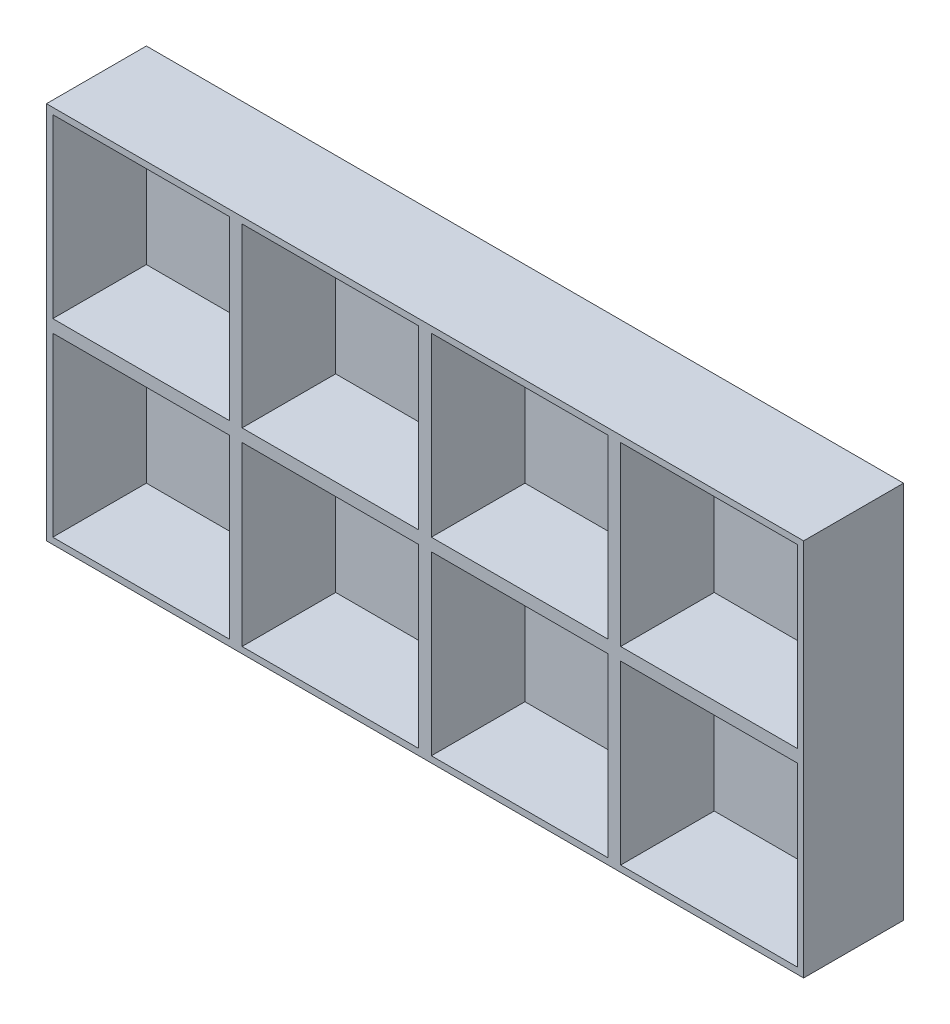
from build123d import *

# Parameters (mm, degrees)
ESQUISSE1_W        = 120
ESQUISSE1_H        = 30
ESQUISSE1_W_2      = 28
ESQUISSE1_H_2      = 28
BOSS_EXTRU_1_DEPTH = 14.833333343
ESQUISSE2_W        = 120
ESQUISSE2_H        = 60
BOSS_EXTRU_2_DEPTH = 1


with BuildPart() as part:
    # Esquisse1 → Boss.-Extru.1 (new body)
    with BuildSketch(Plane.XY):
        with Locations((60, 15)):
            Rectangle(ESQUISSE1_W, ESQUISSE1_H)
        with Locations((45, 15)):
            Rectangle(ESQUISSE1_W_2, ESQUISSE1_H_2, mode=Mode.SUBTRACT)
        with Locations((75, 15)):
            Rectangle(ESQUISSE1_W_2, ESQUISSE1_H_2, mode=Mode.SUBTRACT)
        with Locations((105, 15)):
            Rectangle(ESQUISSE1_W_2, ESQUISSE1_H_2, mode=Mode.SUBTRACT)
        with Locations((15, 15)):
            Rectangle(ESQUISSE1_W_2, ESQUISSE1_H_2, mode=Mode.SUBTRACT)
    boss_extru_1 = extrude(amount=BOSS_EXTRU_1_DEPTH)

    # Sym_trie1: Boss.-Extru.1 across plane
    add(boss_extru_1.mirror(Plane(origin=(0, 0, 14.833333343), x_dir=(0, 0, 1), z_dir=(0, 1, 0))))

    # Esquisse2 → Boss.-Extru.2 (add)
    with BuildSketch(Plane(origin=(0, 0, 0), x_dir=(-1, 0, 0), z_dir=(0, 0, -1))):
        with Locations((-60, 0)):
            Rectangle(ESQUISSE2_W, ESQUISSE2_H)
    extrude(amount=BOSS_EXTRU_2_DEPTH)


solid = part.part
